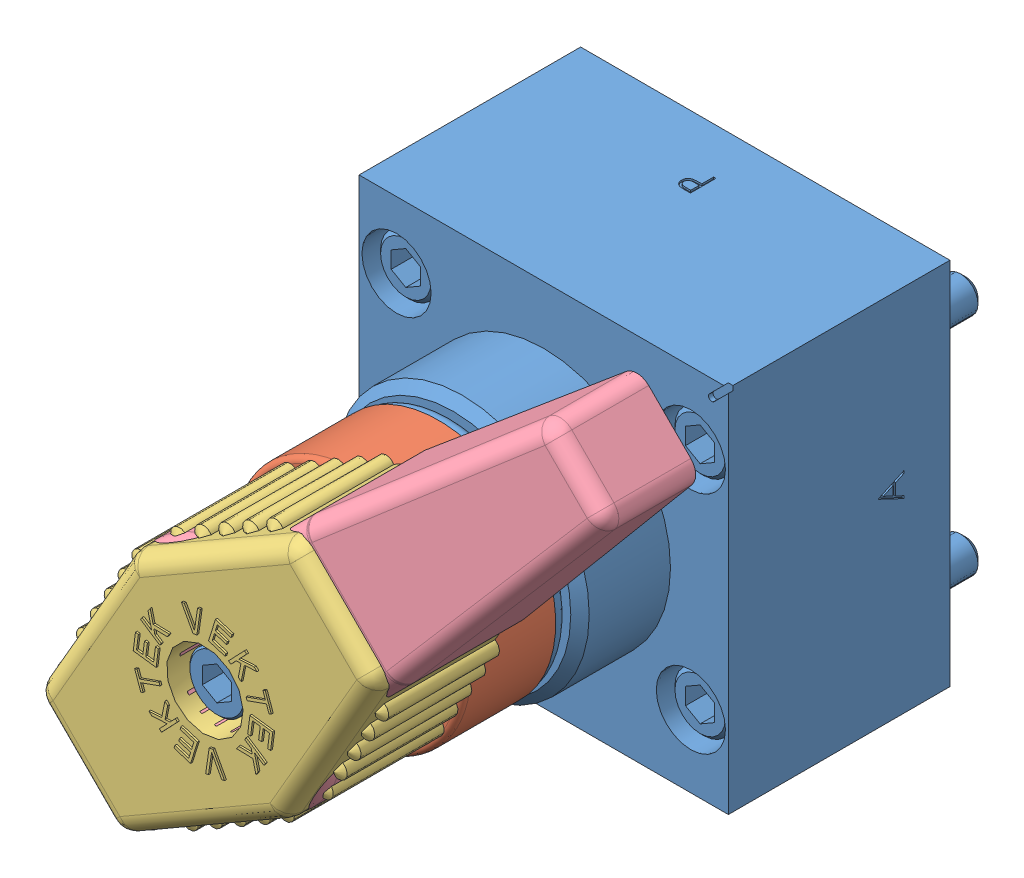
SolidWorks assembly ILC71142204.SLDASM, configuration Default (file format 5000). Lengths in mm.
Overall size (58.16 58.16 85.03).
4 component instances, 4 part files, 9 mates.
Components (placement in the parent):
- ILC71142204_BASE-1: ILC71142204_BASE.sldprt [Default] at (6.2233 -23.0747 -25.4965) size (50.8 50.8 82.8)
- ILC71142204_ADAPTER-1: ILC71142204_ADAPTER.sldprt [Default] at (-19.1767 2.3253 40.6705) x (0 0 -1) z (0.707107 0.707107 0) size (22.23 32.26 32.26)
- 85600903-1: 85600903.sldprt [Default] at (-19.1767 2.3253 51.5925) x (0.707107 0.707107 0) z (0.707107 -0.707107 0) size (51.61 19.62 30.64)
- 85600902-1: 85600902.SLDPRT [Default] at (-19.1767 2.3253 32.5425) x (0 0 1) z (0.707107 -0.707107 0) size (17.76 89.76 30.23) (hidden)
Mates (geometry in assembly coordinates):
- Concentric1: concentric aligned: cylinder of ILC71142204_BASE-1 through (-19.1767 2.3253 34.8729) axis (0 0 1) radius 3.9624; cylinder of ILC71142204_ADAPTER-1 through (-19.1767 2.3253 12.3659) axis (0 0 1) radius 6.35
- Coincident1: coincident anti-aligned: plane of ILC71142204_BASE-1 through (-19.1767 2.3253 18.4455) normal (0 0 1); plane of ILC71142204_ADAPTER-1 through (-19.1767 2.3253 18.4455) normal (0 0 -1)
- Parallel1: parallel aligned: plane of ILC71142204_BASE-1 through (4.2548 25.1218 4.9835) normal (-0.707107 0.707107 0); plane of ILC71142204_ADAPTER-1 through (-30.1749 6.8809 40.6705) normal (-0.707107 0.707107 0)
- Concentric2: concentric aligned: cylinder of ILC71142204_BASE-1 through (-19.1767 2.3253 34.8729) axis (0 0 1) radius 2.413; cylinder of 85600903-1 through (-19.1767 2.3253 23.2959) axis (0 0 1) radius 5.2705
- Parallel2: parallel anti-aligned: plane of ILC71142204_ADAPTER-1 through (-30.1749 6.8809 40.6705) normal (-0.707107 0.707107 0); plane of 85600903-1 through (-30.3527 6.9546 32.5425) normal (0.707107 -0.707107 0)
- Coincident4: coincident anti-aligned: plane of ILC71142204_ADAPTER-1 through (-19.1767 2.3253 40.6705) normal (0 0 1); plane of 85600903-1 through (-19.1767 2.3253 40.6705) normal (0 0 -1)
- Concentric3: concentric aligned: cylinder of ILC71142204_BASE-1 through (-19.1767 2.3253 34.8729) axis (0 0 1) radius 3.9624; cylinder of 85600902-1 through (-19.1767 2.3253 36.4795) axis (0 0 1) radius 5.2705
- Parallel3: parallel anti-aligned: plane of ILC71142204_BASE-1 through (4.2548 25.1218 4.9835) normal (-0.707107 0.707107 0); plane of 85600902-1 through (5.519 13.5506 32.5425) normal (0.707107 -0.707107 0)
- Coincident6: coincident anti-aligned: plane of ILC71142204_ADAPTER-1 through (-19.1767 2.3253 40.6705) normal (0 0 1); plane of 85600902-1 through (-19.1767 2.3253 40.6705) normal (0 0 -1)
